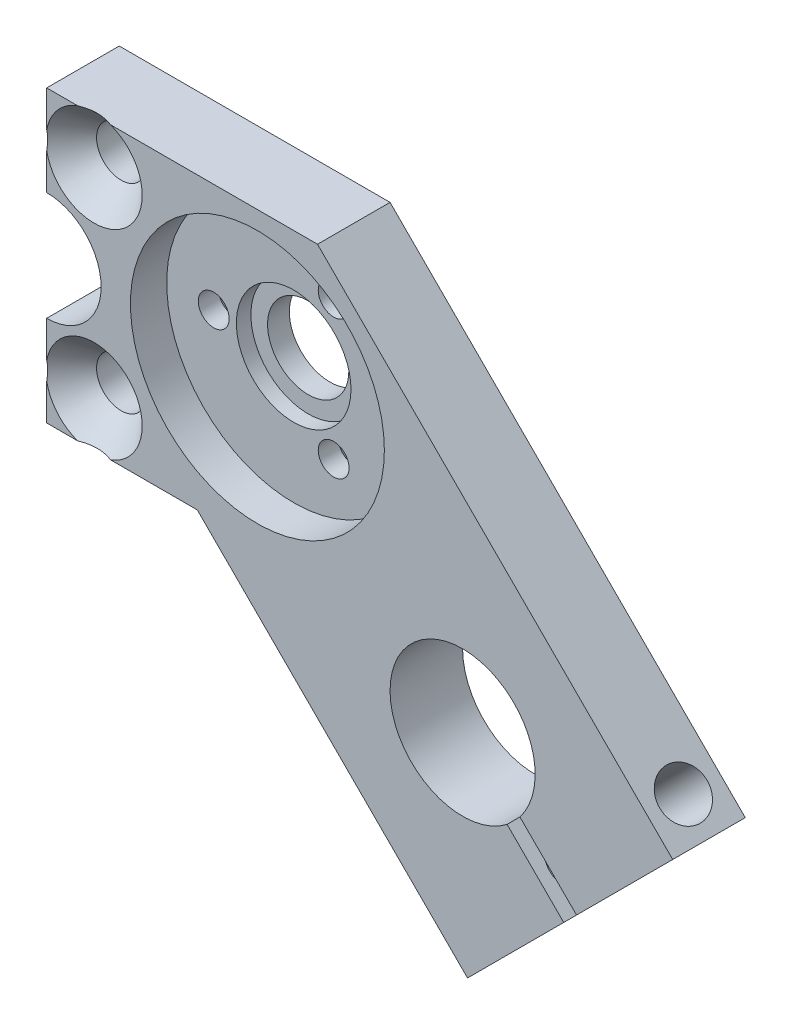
from build123d import *

# Parameters (mm, degrees)
SKETCH1_R                                         = 3.556
EXTRUDE1_DEPTH                                    = 6.35
CSK_FOR_8_FLAT_HEAD_MACHINE_SCREW1_D              = 4.3053
CSK_FOR_8_FLAT_HEAD_MACHINE_SCREW1_CSINK_D        = 8.4328
CSK_FOR_8_FLAT_HEAD_MACHINE_SCREW1_CSINK_ANGLE    = 82
SKETCH3_R                                         = 11.1125
CUT_EXTRUDE1_DEPTH                                = 3.175
SKETCH4_R                                         = 5.0165
CUT_EXTRUDE2_DEPTH                                = 1.27
CSK_FOR_M2_5_FLAT_HEAD_MACHINE_SCREW1_D           = 2.7
CSK_FOR_M2_5_FLAT_HEAD_MACHINE_SCREW1_CSINK_D     = 5.5
CSK_FOR_M2_5_FLAT_HEAD_MACHINE_SCREW1_CSINK_ANGLE = 90
CIRPATTERN1_COUNT                                 = 3
F_8_CLEARANCE_HOLE1_D                             = 4.3053
F_8_CLEARANCE_HOLE1_DEPTH                         = 12.7
F_8_CLEARANCE_HOLE1_TIP                           = 1.293442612
F_8_32_TAPPED_HOLE1_D                             = 3.4544
F_8_32_TAPPED_HOLE1_DEPTH                         = 14.986
F_8_32_TAPPED_HOLE1_CBORE_D                       = 4.1656
F_8_32_TAPPED_HOLE1_CBORE_DEPTH                   = 12.7
F_8_32_TAPPED_HOLE1_TIP                           = 1.037806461


with BuildPart() as part:
    # Sketch1 → Extrude1 (new body)
    with BuildSketch(Plane.XY):
        with BuildLine():
            Line((-18.4404, -4.7625), (-18.4404, -12.7))
            Line((-18.4404, -12.7), (-5.260512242, -12.7))
            Line((-5.260512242, -12.7), (18.391564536, -36.352076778))
            Line((18.391564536, -36.352076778), (26.810554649, -27.933086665))
            Line((26.810554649, -27.933086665), (21.854157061, -22.976689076))
            ThreePointArc((21.854157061, -22.976689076), (13.470384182, -13.470384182), (22.976689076, -21.854157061))
            Line((22.976689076, -21.854157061), (27.933086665, -26.810554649))
            Line((27.933086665, -26.810554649), (36.352076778, -18.391564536))
            Line((36.352076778, -18.391564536), (5.260512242, 12.7))
            Line((5.260512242, 12.7), (-18.4404, 12.7))
            Line((-18.4404, 12.7), (-18.4404, 4.7625))
            ThreePointArc((-18.4404, 4.7625), (-13.6779, 0), (-18.4404, -4.7625))
        make_face()
        Circle(SKETCH1_R, mode=Mode.SUBTRACT)
    extrude(amount=EXTRUDE1_DEPTH)

    # CSK for _8 Flat Head Machine Screw1 (through all)
    with Locations(Plane(origin=(-14.3002, 8.7376, 6.35), x_dir=(1, 0, 0), z_dir=(0, 0, 1))):
        with Locations((0, 0), (0, -17.4752)):
            CounterSinkHole(CSK_FOR_8_FLAT_HEAD_MACHINE_SCREW1_D / 2, CSK_FOR_8_FLAT_HEAD_MACHINE_SCREW1_CSINK_D / 2, counter_sink_angle=CSK_FOR_8_FLAT_HEAD_MACHINE_SCREW1_CSINK_ANGLE)

    # Sketch3 → Cut-Extrude1 (cut)
    with BuildSketch(Plane.XY.offset(6.35)):
        Circle(SKETCH3_R)
    extrude(amount=-CUT_EXTRUDE1_DEPTH, mode=Mode.SUBTRACT)

    # Sketch4 → Cut-Extrude2 (cut)
    with BuildSketch(Plane.XY.offset(3.175)):
        Circle(SKETCH4_R)
    extrude(amount=-CUT_EXTRUDE2_DEPTH, mode=Mode.SUBTRACT)

    # CSK for M2.5 Flat Head Machine Screw1 (through all)
    with Locations(Plane(origin=(-7.000398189, 0, 0), x_dir=(-1, 0, 0), z_dir=(0, 0, -1))):
        with Locations((0, 0)):
            csk_for_m2_5_flat_head_machine_screw1 = CounterSinkHole(CSK_FOR_M2_5_FLAT_HEAD_MACHINE_SCREW1_D / 2, CSK_FOR_M2_5_FLAT_HEAD_MACHINE_SCREW1_CSINK_D / 2, counter_sink_angle=CSK_FOR_M2_5_FLAT_HEAD_MACHINE_SCREW1_CSINK_ANGLE)

    # CirPattern1: CSK for M2.5 Flat Head Machine Screw1 ×3 about axis
    cirpattern1_axis = Axis((0, 0, 0), (0, 0, 1))
    for i in range(1, CIRPATTERN1_COUNT):
        add(csk_for_m2_5_flat_head_machine_screw1.rotate(cirpattern1_axis, i * 360 / CIRPATTERN1_COUNT), mode=Mode.SUBTRACT)

    # 8 Clearance Hole1
    with Locations(Plane(origin=(16.146500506, -34.107012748, 3.175), x_dir=(0.707106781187, -0.707106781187, 0), z_dir=(-0.707106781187, -0.707106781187, 0))):
        with Locations((0, 0)):
            Hole(F_8_CLEARANCE_HOLE1_D / 2, depth=F_8_CLEARANCE_HOLE1_DEPTH)
            with Locations((0, 0, -(F_8_CLEARANCE_HOLE1_DEPTH + F_8_CLEARANCE_HOLE1_TIP / 2))):  # 118° drill point
                Cone(0, F_8_CLEARANCE_HOLE1_D / 2, F_8_CLEARANCE_HOLE1_TIP, mode=Mode.SUBTRACT)

    # 8-32 Tapped Hole1
    with Locations(Plane(origin=(34.107012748, -16.146500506, 3.175), x_dir=(-0.707106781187, 0.707106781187, 0), z_dir=(0.707106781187, 0.707106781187, 0))):
        with Locations((0, 0)):
            CounterBoreHole(F_8_32_TAPPED_HOLE1_D / 2, F_8_32_TAPPED_HOLE1_CBORE_D / 2, F_8_32_TAPPED_HOLE1_CBORE_DEPTH, depth=F_8_32_TAPPED_HOLE1_DEPTH)
            with Locations((0, 0, -(F_8_32_TAPPED_HOLE1_DEPTH + F_8_32_TAPPED_HOLE1_TIP / 2))):  # 118° drill point
                Cone(0, F_8_32_TAPPED_HOLE1_D / 2, F_8_32_TAPPED_HOLE1_TIP, mode=Mode.SUBTRACT)


solid = part.part
